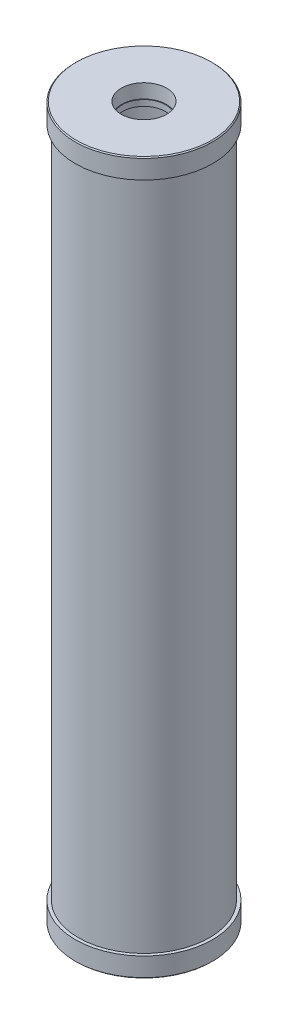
from build123d import *

# Parameters (mm, degrees)
SKETCH1_R           = 84.201
SKETCH1_R_2         = 74.676
BOSS_EXTRUDE1_DEPTH = 914.4
SKETCH2_R           = 88.265
BOSS_EXTRUDE2_DEPTH = 25.4
BOSS_EXTRUDE3_START = -25.4
SKETCH3_R           = 88.265
BOSS_EXTRUDE3_DEPTH = 25.4
CHAMFER1_SIZE       = 1.27


with BuildPart() as part:
    # Sketch1 → Boss-Extrude1 (new body)
    with BuildSketch(Plane(origin=(0, 0, 0), x_dir=(1, 0, 0), z_dir=(0, 1, 0))):
        with Locations(Location((0, 0, 0), (0, 0, 270))):
            Circle(SKETCH1_R)
        with Locations(Location((0, 0, 0), (0, 0, 270))):
            Circle(SKETCH1_R_2, mode=Mode.SUBTRACT)
    extrude(amount=BOSS_EXTRUDE1_DEPTH)

    # Sketch2 → Boss-Extrude2 (add)
    with BuildSketch(Plane(origin=(0, 0, 0), x_dir=(1, 0, 0), z_dir=(0, 1, 0))):
        with Locations(Location((0, 0, 0), (0, 0, 270))):
            Circle(SKETCH2_R)
    extrude(amount=BOSS_EXTRUDE2_DEPTH)

    # Sketch3 → Boss-Extrude3 (add)
    with BuildSketch(Plane(origin=(0, 914.4, 0), x_dir=(1, 0, 0), z_dir=(0, 1, 0)).offset(BOSS_EXTRUDE3_START)):
        with Locations(Location((0, 0, 0), (0, 0, 270))):
            Circle(SKETCH3_R)
    extrude(amount=BOSS_EXTRUDE3_DEPTH)

    # Sketch4 → 2 NPT Tapped Hole1 (revolve, cut)
    with BuildSketch(Plane(origin=(0, 914.4, 0), x_dir=(0, 0, 1), z_dir=(1, 0, 0))):
        Polygon((0, 0), (0, 45.652474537), (27.7876, 28.956), (27.7876, 17.78), (28.63263419, 17.78), (29.1649912, 0), align=None)
    revolve(axis=Axis((0, 920.75, 0), (0, -1, 0)), mode=Mode.SUBTRACT)

    # Sketch10 → 2 NPT Tapped Hole3 (revolve, cut)
    with BuildSketch(Plane(origin=(0, 0, 0), x_dir=(0, 0, -1), z_dir=(1, 0, 0))):
        Polygon((0, 0), (0, 45.652474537), (27.7876, 28.956), (27.7876, 17.78), (28.63263419, 17.78), (29.1649912, 0), align=None)
    revolve(axis=Axis((0, -6.35, 0), (0, 1, 0)), mode=Mode.SUBTRACT)

    # Chamfer1
    chamfer1_edges = [part.edges().sort_by_distance(p)[0] for p in [
        (0, 0, -88.265),
        (0, 914.4, -88.265),
    ]]
    chamfer(chamfer1_edges, length=CHAMFER1_SIZE)


solid = part.part
